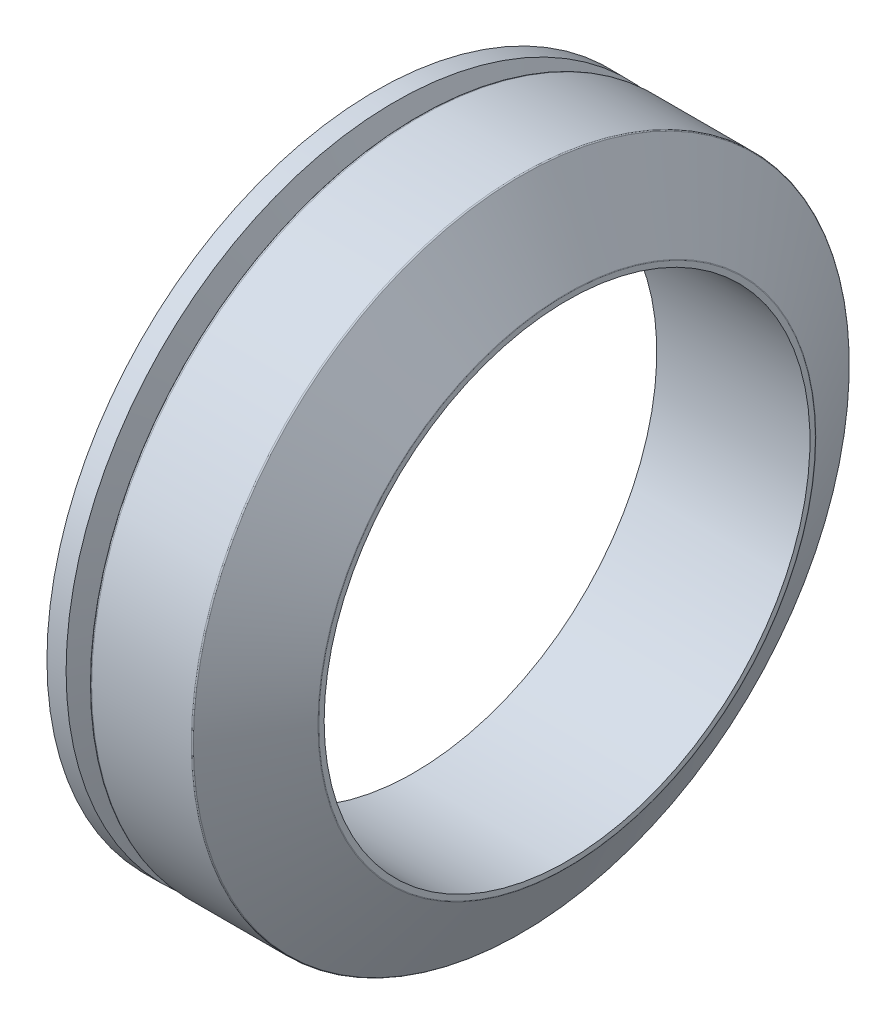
ISO-10303-21;
HEADER;
FILE_DESCRIPTION(('STEP AP214'),'2;1');
FILE_NAME('part.step','',(''),(''),'','','');
FILE_SCHEMA(('AUTOMOTIVE_DESIGN { 1 0 10303 214 1 1 1 1 }'));
ENDSEC;
DATA;
#1=APPLICATION_CONTEXT('core data for automotive mechanical design processes');
#2=APPLICATION_PROTOCOL_DEFINITION('international standard','automotive_design',2000,#1);
#3=PRODUCT_CONTEXT('',#1,'mechanical');
#4=PRODUCT('Part','Part','',(#3));
#5=PRODUCT_RELATED_PRODUCT_CATEGORY('part','',(#4));
#6=PRODUCT_DEFINITION_FORMATION('','',#4);
#7=PRODUCT_DEFINITION_CONTEXT('part definition',#1,'design');
#8=PRODUCT_DEFINITION('design','',#6,#7);
#9=PRODUCT_DEFINITION_SHAPE('','',#8);
#10=(LENGTH_UNIT() NAMED_UNIT(*) SI_UNIT(.MILLI.,.METRE.));
#11=(NAMED_UNIT(*) PLANE_ANGLE_UNIT() SI_UNIT($,.RADIAN.));
#12=(NAMED_UNIT(*) SI_UNIT($,.STERADIAN.) SOLID_ANGLE_UNIT());
#13=UNCERTAINTY_MEASURE_WITH_UNIT(LENGTH_MEASURE(1.E-05),#10,'distance_accuracy_value','');
#14=(GEOMETRIC_REPRESENTATION_CONTEXT(3) GLOBAL_UNCERTAINTY_ASSIGNED_CONTEXT((#13)) GLOBAL_UNIT_ASSIGNED_CONTEXT((#10,
#11,#12)) REPRESENTATION_CONTEXT('',''));
#15=CARTESIAN_POINT('',(0.,0.,0.));
#16=DIRECTION('',(0.,0.,1.));
#17=DIRECTION('',(1.,0.,0.));
#18=AXIS2_PLACEMENT_3D('',#15,#16,#17);
#19=CARTESIAN_POINT('',(1.56435578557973,0.,0.));
#20=DIRECTION('',(-1.,0.,0.));
#21=DIRECTION('',(0.,0.,1.));
#22=AXIS2_PLACEMENT_3D('',#19,#20,#21);
#23=TOROIDAL_SURFACE('',#22,11.4,0.0999999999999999);
#24=CARTESIAN_POINT('',(1.46587501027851,0.,0.));
#25=DIRECTION('',(-1.,0.,0.));
#26=DIRECTION('',(0.,0.,1.));
#27=AXIS2_PLACEMENT_3D('',#24,#25,#26);
#28=CIRCLE('',#27,11.4173648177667);
#29=CARTESIAN_POINT('',(1.46587501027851,0.,11.4173648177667));
#30=VERTEX_POINT('',#29);
#31=EDGE_CURVE('E64',#30,#30,#28,.T.);
#32=ORIENTED_EDGE('',*,*,#31,.F.);
#33=EDGE_LOOP('',(#32));
#34=FACE_BOUND('',#33,.T.);
#35=CARTESIAN_POINT('',(1.56435578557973,0.,0.));
#36=DIRECTION('',(-1.,0.,0.));
#37=DIRECTION('',(0.,0.,1.));
#38=AXIS2_PLACEMENT_3D('',#35,#36,#37);
#39=CIRCLE('',#38,11.5);
#40=CARTESIAN_POINT('',(1.56435578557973,0.,11.5));
#41=VERTEX_POINT('',#40);
#42=EDGE_CURVE('E10',#41,#41,#39,.T.);
#43=ORIENTED_EDGE('',*,*,#42,.T.);
#44=EDGE_LOOP('',(#43));
#45=FACE_BOUND('',#44,.T.);
#46=ADVANCED_FACE('F27',(#34,#45),#23,.T.);
#47=CARTESIAN_POINT('',(0.,0.,0.));
#48=DIRECTION('',(-1.,0.,0.));
#49=DIRECTION('',(0.,0.,1.));
#50=AXIS2_PLACEMENT_3D('',#47,#48,#49);
#51=CYLINDRICAL_SURFACE('',#50,11.5);
#52=ORIENTED_EDGE('',*,*,#42,.F.);
#53=EDGE_LOOP('',(#52));
#54=FACE_BOUND('',#53,.T.);
#55=CARTESIAN_POINT('',(5.05455173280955,0.,0.));
#56=DIRECTION('',(-1.,0.,0.));
#57=DIRECTION('',(0.,0.,1.));
#58=AXIS2_PLACEMENT_3D('',#55,#56,#57);
#59=CIRCLE('',#58,11.5);
#60=CARTESIAN_POINT('',(5.05455173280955,0.,11.5));
#61=VERTEX_POINT('',#60);
#62=EDGE_CURVE('E33',#61,#61,#59,.T.);
#63=ORIENTED_EDGE('',*,*,#62,.T.);
#64=EDGE_LOOP('',(#63));
#65=FACE_BOUND('',#64,.T.);
#66=ADVANCED_FACE('F71',(#54,#65),#51,.T.);
#67=CARTESIAN_POINT('',(5.05455173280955,0.,0.));
#68=DIRECTION('',(-1.,0.,0.));
#69=DIRECTION('',(0.,0.,1.));
#70=AXIS2_PLACEMENT_3D('',#67,#68,#69);
#71=TOROIDAL_SURFACE('',#70,11.45,0.0499999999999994);
#72=ORIENTED_EDGE('',*,*,#62,.F.);
#73=EDGE_LOOP('',(#72));
#74=FACE_BOUND('',#73,.T.);
#75=CARTESIAN_POINT('',(5.09785300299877,0.,0.));
#76=DIRECTION('',(-1.,0.,0.));
#77=DIRECTION('',(0.,0.,1.));
#78=AXIS2_PLACEMENT_3D('',#75,#76,#77);
#79=CIRCLE('',#78,11.475);
#80=CARTESIAN_POINT('',(5.09785300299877,0.,11.475));
#81=VERTEX_POINT('',#80);
#82=EDGE_CURVE('E37',#81,#81,#79,.T.);
#83=ORIENTED_EDGE('',*,*,#82,.T.);
#84=EDGE_LOOP('',(#83));
#85=FACE_BOUND('',#84,.T.);
#86=ADVANCED_FACE('F75',(#74,#85),#71,.T.);
#87=CARTESIAN_POINT('',(6.69330127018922,0.,0.));
#88=DIRECTION('',(-1.,0.,0.));
#89=DIRECTION('',(0.,0.,1.));
#90=AXIS2_PLACEMENT_3D('',#87,#88,#89);
#91=CONICAL_SURFACE('',#90,8.71160254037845,1.04719755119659);
#92=ORIENTED_EDGE('',*,*,#82,.F.);
#93=EDGE_LOOP('',(#92));
#94=FACE_BOUND('',#93,.T.);
#95=CARTESIAN_POINT('',(6.69330127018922,0.,0.));
#96=DIRECTION('',(-1.,0.,0.));
#97=DIRECTION('',(0.,0.,1.));
#98=AXIS2_PLACEMENT_3D('',#95,#96,#97);
#99=CIRCLE('',#98,8.71160254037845);
#100=CARTESIAN_POINT('',(6.69330127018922,0.,8.71160254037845));
#101=VERTEX_POINT('',#100);
#102=EDGE_CURVE('E41',#101,#101,#99,.T.);
#103=ORIENTED_EDGE('',*,*,#102,.T.);
#104=EDGE_LOOP('',(#103));
#105=FACE_BOUND('',#104,.T.);
#106=ADVANCED_FACE('F80',(#94,#105),#91,.T.);
#107=CARTESIAN_POINT('',(6.65,0.,0.));
#108=DIRECTION('',(-1.,0.,0.));
#109=DIRECTION('',(0.,0.,1.));
#110=AXIS2_PLACEMENT_3D('',#107,#108,#109);
#111=TOROIDAL_SURFACE('',#110,8.68660254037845,0.0500000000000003);
#112=ORIENTED_EDGE('',*,*,#102,.F.);
#113=EDGE_LOOP('',(#112));
#114=FACE_BOUND('',#113,.T.);
#115=CARTESIAN_POINT('',(6.7,0.,0.));
#116=DIRECTION('',(-1.,0.,0.));
#117=DIRECTION('',(0.,0.,1.));
#118=AXIS2_PLACEMENT_3D('',#115,#116,#117);
#119=CIRCLE('',#118,8.68660254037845);
#120=CARTESIAN_POINT('',(6.7,0.,8.68660254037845));
#121=VERTEX_POINT('',#120);
#122=EDGE_CURVE('E46',#121,#121,#119,.T.);
#123=ORIENTED_EDGE('',*,*,#122,.T.);
#124=EDGE_LOOP('',(#123));
#125=FACE_BOUND('',#124,.T.);
#126=ADVANCED_FACE('F86',(#114,#125),#111,.T.);
#127=CARTESIAN_POINT('',(6.7,8.5,0.));
#128=DIRECTION('',(-1.,0.,0.));
#129=DIRECTION('',(0.,0.,1.));
#130=AXIS2_PLACEMENT_3D('',#127,#128,#129);
#131=PLANE('',#130);
#132=ORIENTED_EDGE('',*,*,#122,.F.);
#133=EDGE_LOOP('',(#132));
#134=FACE_BOUND('',#133,.T.);
#135=CARTESIAN_POINT('',(6.7,0.,0.));
#136=DIRECTION('',(-1.,0.,0.));
#137=DIRECTION('',(0.,0.,1.));
#138=AXIS2_PLACEMENT_3D('',#135,#136,#137);
#139=CIRCLE('',#138,8.5);
#140=CARTESIAN_POINT('',(6.7,0.,8.5));
#141=VERTEX_POINT('',#140);
#142=EDGE_CURVE('E49',#141,#141,#139,.T.);
#143=ORIENTED_EDGE('',*,*,#142,.T.);
#144=EDGE_LOOP('',(#143));
#145=FACE_BOUND('',#144,.T.);
#146=ADVANCED_FACE('F90',(#134,#145),#131,.F.);
#147=CARTESIAN_POINT('',(0.,0.,0.));
#148=DIRECTION('',(-1.,0.,0.));
#149=DIRECTION('',(0.,0.,1.));
#150=AXIS2_PLACEMENT_3D('',#147,#148,#149);
#151=CYLINDRICAL_SURFACE('',#150,8.5);
#152=ORIENTED_EDGE('',*,*,#142,.F.);
#153=EDGE_LOOP('',(#152));
#154=FACE_BOUND('',#153,.T.);
#155=CARTESIAN_POINT('',(1.34,0.,0.));
#156=DIRECTION('',(-1.,0.,0.));
#157=DIRECTION('',(0.,0.,1.));
#158=AXIS2_PLACEMENT_3D('',#155,#156,#157);
#159=CIRCLE('',#158,8.5);
#160=CARTESIAN_POINT('',(1.34,0.,8.5));
#161=VERTEX_POINT('',#160);
#162=EDGE_CURVE('E52',#161,#161,#159,.T.);
#163=ORIENTED_EDGE('',*,*,#162,.T.);
#164=EDGE_LOOP('',(#163));
#165=FACE_BOUND('',#164,.T.);
#166=ADVANCED_FACE('F94',(#154,#165),#151,.F.);
#167=CARTESIAN_POINT('',(0.,0.,0.));
#168=DIRECTION('',(-1.,0.,0.));
#169=DIRECTION('',(0.,0.,1.));
#170=AXIS2_PLACEMENT_3D('',#167,#168,#169);
#171=CONICAL_SURFACE('',#170,11.5,1.1507178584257);
#172=ORIENTED_EDGE('',*,*,#162,.F.);
#173=EDGE_LOOP('',(#172));
#174=FACE_BOUND('',#173,.T.);
#175=CARTESIAN_POINT('',(0.,0.,0.));
#176=DIRECTION('',(-1.,0.,0.));
#177=DIRECTION('',(0.,0.,1.));
#178=AXIS2_PLACEMENT_3D('',#175,#176,#177);
#179=CIRCLE('',#178,11.5);
#180=CARTESIAN_POINT('',(0.,0.,11.5));
#181=VERTEX_POINT('',#180);
#182=EDGE_CURVE('E55',#181,#181,#179,.T.);
#183=ORIENTED_EDGE('',*,*,#182,.T.);
#184=EDGE_LOOP('',(#183));
#185=FACE_BOUND('',#184,.T.);
#186=ADVANCED_FACE('F98',(#174,#185),#171,.F.);
#187=CARTESIAN_POINT('',(0.,0.,0.));
#188=DIRECTION('',(-1.,0.,0.));
#189=DIRECTION('',(0.,0.,1.));
#190=AXIS2_PLACEMENT_3D('',#187,#188,#189);
#191=CYLINDRICAL_SURFACE('',#190,11.5);
#192=ORIENTED_EDGE('',*,*,#182,.F.);
#193=EDGE_LOOP('',(#192));
#194=FACE_BOUND('',#193,.T.);
#195=CARTESIAN_POINT('',(0.67,0.,0.));
#196=DIRECTION('',(-1.,0.,0.));
#197=DIRECTION('',(0.,0.,1.));
#198=AXIS2_PLACEMENT_3D('',#195,#196,#197);
#199=CIRCLE('',#198,11.5);
#200=CARTESIAN_POINT('',(0.67,0.,11.5));
#201=VERTEX_POINT('',#200);
#202=EDGE_CURVE('E58',#201,#201,#199,.T.);
#203=ORIENTED_EDGE('',*,*,#202,.T.);
#204=EDGE_LOOP('',(#203));
#205=FACE_BOUND('',#204,.T.);
#206=ADVANCED_FACE('F102',(#194,#205),#191,.T.);
#207=CARTESIAN_POINT('',(1.2159553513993,0.,0.));
#208=DIRECTION('',(-1.,0.,0.));
#209=DIRECTION('',(0.,0.,1.));
#210=AXIS2_PLACEMENT_3D('',#207,#208,#209);
#211=CONICAL_SURFACE('',#210,10.,1.22173047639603);
#212=ORIENTED_EDGE('',*,*,#202,.F.);
#213=EDGE_LOOP('',(#212));
#214=FACE_BOUND('',#213,.T.);
#215=CARTESIAN_POINT('',(1.2159553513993,0.,0.));
#216=DIRECTION('',(-1.,0.,0.));
#217=DIRECTION('',(0.,0.,1.));
#218=AXIS2_PLACEMENT_3D('',#215,#216,#217);
#219=CIRCLE('',#218,10.);
#220=CARTESIAN_POINT('',(1.2159553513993,0.,10.));
#221=VERTEX_POINT('',#220);
#222=EDGE_CURVE('E61',#221,#221,#219,.T.);
#223=ORIENTED_EDGE('',*,*,#222,.T.);
#224=EDGE_LOOP('',(#223));
#225=FACE_BOUND('',#224,.T.);
#226=ADVANCED_FACE('F106',(#214,#225),#211,.T.);
#227=CARTESIAN_POINT('',(1.46587501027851,0.,0.));
#228=DIRECTION('',(1.,0.,0.));
#229=DIRECTION('',(0.,0.,-1.));
#230=AXIS2_PLACEMENT_3D('',#227,#228,#229);
#231=CONICAL_SURFACE('',#230,11.4173648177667,1.39626340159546);
#232=ORIENTED_EDGE('',*,*,#222,.F.);
#233=EDGE_LOOP('',(#232));
#234=FACE_BOUND('',#233,.T.);
#235=ORIENTED_EDGE('',*,*,#31,.T.);
#236=EDGE_LOOP('',(#235));
#237=FACE_BOUND('',#236,.T.);
#238=ADVANCED_FACE('F68',(#234,#237),#231,.T.);
#239=CLOSED_SHELL('',(#46,#66,#86,#106,#126,#146,#166,#186,#206,#226,#238));
#240=MANIFOLD_SOLID_BREP('B2',#239);
#241=ADVANCED_BREP_SHAPE_REPRESENTATION('',(#18,#240),#14);
#242=SHAPE_DEFINITION_REPRESENTATION(#9,#241);
ENDSEC;
END-ISO-10303-21;
